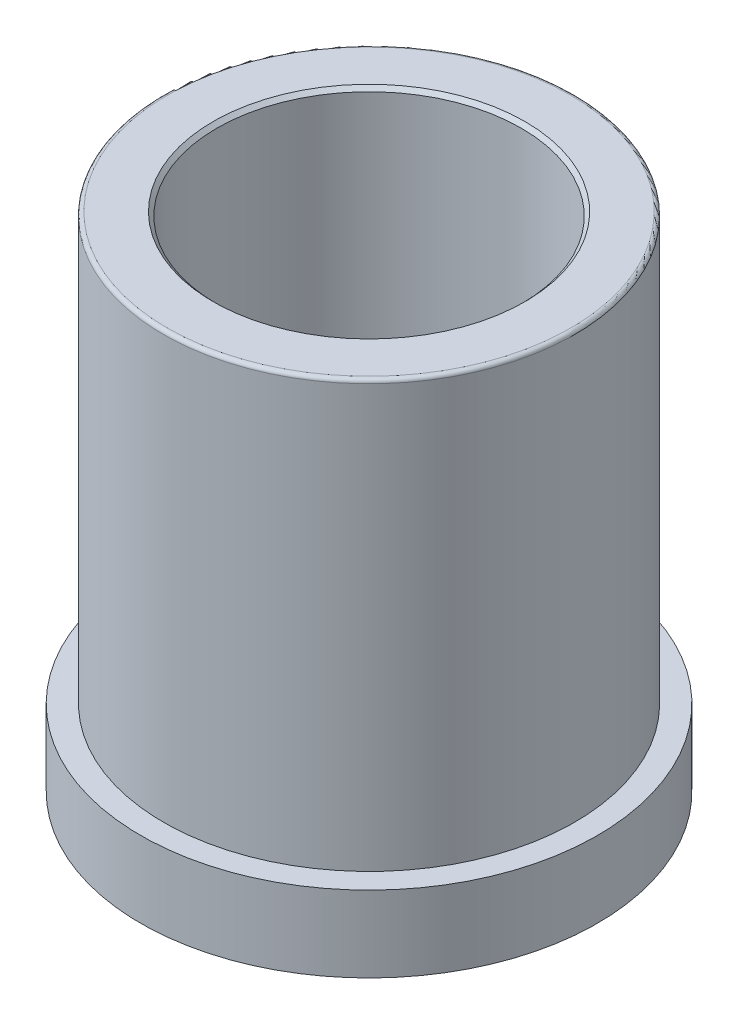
ISO-10303-21;
HEADER;
FILE_DESCRIPTION(('STEP AP214'),'2;1');
FILE_NAME('part.step','',(''),(''),'','','');
FILE_SCHEMA(('AUTOMOTIVE_DESIGN { 1 0 10303 214 1 1 1 1 }'));
ENDSEC;
DATA;
#1=APPLICATION_CONTEXT('core data for automotive mechanical design processes');
#2=APPLICATION_PROTOCOL_DEFINITION('international standard','automotive_design',2000,#1);
#3=PRODUCT_CONTEXT('',#1,'mechanical');
#4=PRODUCT('Part','Part','',(#3));
#5=PRODUCT_RELATED_PRODUCT_CATEGORY('part','',(#4));
#6=PRODUCT_DEFINITION_FORMATION('','',#4);
#7=PRODUCT_DEFINITION_CONTEXT('part definition',#1,'design');
#8=PRODUCT_DEFINITION('design','',#6,#7);
#9=PRODUCT_DEFINITION_SHAPE('','',#8);
#10=(LENGTH_UNIT() NAMED_UNIT(*) SI_UNIT(.MILLI.,.METRE.));
#11=(NAMED_UNIT(*) PLANE_ANGLE_UNIT() SI_UNIT($,.RADIAN.));
#12=(NAMED_UNIT(*) SI_UNIT($,.STERADIAN.) SOLID_ANGLE_UNIT());
#13=UNCERTAINTY_MEASURE_WITH_UNIT(LENGTH_MEASURE(1.E-05),#10,'distance_accuracy_value','');
#14=(GEOMETRIC_REPRESENTATION_CONTEXT(3) GLOBAL_UNCERTAINTY_ASSIGNED_CONTEXT((#13)) GLOBAL_UNIT_ASSIGNED_CONTEXT((#10,
#11,#12)) REPRESENTATION_CONTEXT('',''));
#15=CARTESIAN_POINT('',(0.,0.,0.));
#16=DIRECTION('',(0.,0.,1.));
#17=DIRECTION('',(1.,0.,0.));
#18=AXIS2_PLACEMENT_3D('',#15,#16,#17);
#19=CARTESIAN_POINT('',(0.,0.,0.));
#20=DIRECTION('',(0.,-1.,0.));
#21=DIRECTION('',(0.,0.,-1.));
#22=AXIS2_PLACEMENT_3D('',#19,#20,#21);
#23=CYLINDRICAL_SURFACE('',#22,27.);
#24=CARTESIAN_POINT('',(0.,55.5,0.));
#25=DIRECTION('',(0.,-1.,0.));
#26=DIRECTION('',(0.,0.,-1.));
#27=AXIS2_PLACEMENT_3D('',#24,#25,#26);
#28=CIRCLE('',#27,27.);
#29=CARTESIAN_POINT('',(0.,55.5,-27.));
#30=VERTEX_POINT('',#29);
#31=EDGE_CURVE('E21',#30,#30,#28,.T.);
#32=ORIENTED_EDGE('',*,*,#31,.T.);
#33=EDGE_LOOP('',(#32));
#34=FACE_BOUND('',#33,.T.);
#35=CARTESIAN_POINT('',(0.,0.,0.));
#36=DIRECTION('',(0.,-1.,0.));
#37=DIRECTION('',(0.,0.,-1.));
#38=AXIS2_PLACEMENT_3D('',#35,#36,#37);
#39=CIRCLE('',#38,27.);
#40=CARTESIAN_POINT('',(0.,0.,-27.));
#41=VERTEX_POINT('',#40);
#42=EDGE_CURVE('E49',#41,#41,#39,.T.);
#43=ORIENTED_EDGE('',*,*,#42,.F.);
#44=EDGE_LOOP('',(#43));
#45=FACE_BOUND('',#44,.T.);
#46=ADVANCED_FACE('F14',(#34,#45),#23,.T.);
#47=CARTESIAN_POINT('',(-27.,56.,0.));
#48=DIRECTION('',(0.,-1.,0.));
#49=DIRECTION('',(0.,0.,-1.));
#50=AXIS2_PLACEMENT_3D('',#47,#48,#49);
#51=PLANE('',#50);
#52=CARTESIAN_POINT('',(0.,56.,0.));
#53=DIRECTION('',(0.,-1.,0.));
#54=DIRECTION('',(0.,0.,-1.));
#55=AXIS2_PLACEMENT_3D('',#52,#53,#54);
#56=CIRCLE('',#55,26.5);
#57=CARTESIAN_POINT('',(0.,56.,-26.5));
#58=VERTEX_POINT('',#57);
#59=EDGE_CURVE('E9',#58,#58,#56,.F.);
#60=ORIENTED_EDGE('',*,*,#59,.T.);
#61=EDGE_LOOP('',(#60));
#62=FACE_BOUND('',#61,.T.);
#63=CARTESIAN_POINT('',(0.,56.,0.));
#64=DIRECTION('',(0.,-1.,0.));
#65=DIRECTION('',(0.,0.,-1.));
#66=AXIS2_PLACEMENT_3D('',#63,#64,#65);
#67=CIRCLE('',#66,20.5);
#68=CARTESIAN_POINT('',(0.,56.,-20.5));
#69=VERTEX_POINT('',#68);
#70=EDGE_CURVE('E37',#69,#69,#67,.T.);
#71=ORIENTED_EDGE('',*,*,#70,.T.);
#72=EDGE_LOOP('',(#71));
#73=FACE_BOUND('',#72,.T.);
#74=ADVANCED_FACE('F56',(#62,#73),#51,.F.);
#75=CARTESIAN_POINT('',(0.,0.,0.));
#76=DIRECTION('',(0.,-1.,0.));
#77=DIRECTION('',(0.,0.,-1.));
#78=AXIS2_PLACEMENT_3D('',#75,#76,#77);
#79=CYLINDRICAL_SURFACE('',#78,20.);
#80=CARTESIAN_POINT('',(0.,55.5,0.));
#81=DIRECTION('',(0.,-1.,0.));
#82=DIRECTION('',(0.,0.,-1.));
#83=AXIS2_PLACEMENT_3D('',#80,#81,#82);
#84=CIRCLE('',#83,20.);
#85=CARTESIAN_POINT('',(0.,55.5,-20.));
#86=VERTEX_POINT('',#85);
#87=EDGE_CURVE('E34',#86,#86,#84,.F.);
#88=ORIENTED_EDGE('',*,*,#87,.T.);
#89=EDGE_LOOP('',(#88));
#90=FACE_BOUND('',#89,.T.);
#91=CARTESIAN_POINT('',(0.,-10.,0.));
#92=DIRECTION('',(0.,-1.,0.));
#93=DIRECTION('',(0.,0.,-1.));
#94=AXIS2_PLACEMENT_3D('',#91,#92,#93);
#95=CIRCLE('',#94,20.);
#96=CARTESIAN_POINT('',(0.,-10.,-20.));
#97=VERTEX_POINT('',#96);
#98=EDGE_CURVE('E40',#97,#97,#95,.T.);
#99=ORIENTED_EDGE('',*,*,#98,.T.);
#100=EDGE_LOOP('',(#99));
#101=FACE_BOUND('',#100,.T.);
#102=ADVANCED_FACE('F63',(#90,#101),#79,.F.);
#103=CARTESIAN_POINT('',(0.,-10.15,0.));
#104=DIRECTION('',(0.,-1.,0.));
#105=DIRECTION('',(0.,0.,-1.));
#106=AXIS2_PLACEMENT_3D('',#103,#104,#105);
#107=CONICAL_SURFACE('',#106,20.1,0.588002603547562);
#108=CARTESIAN_POINT('',(0.,-10.36,0.));
#109=DIRECTION('',(0.,1.,0.));
#110=DIRECTION('',(0.,0.,1.));
#111=AXIS2_PLACEMENT_3D('',#108,#109,#110);
#112=CIRCLE('',#111,20.24);
#113=CARTESIAN_POINT('',(0.,-10.36,20.24));
#114=VERTEX_POINT('',#113);
#115=EDGE_CURVE('E25',#114,#114,#112,.F.);
#116=ORIENTED_EDGE('',*,*,#115,.T.);
#117=EDGE_LOOP('',(#116));
#118=FACE_BOUND('',#117,.T.);
#119=ORIENTED_EDGE('',*,*,#98,.F.);
#120=EDGE_LOOP('',(#119));
#121=FACE_BOUND('',#120,.T.);
#122=ADVANCED_FACE('F82',(#118,#121),#107,.F.);
#123=CARTESIAN_POINT('',(-20.1,-10.,0.));
#124=DIRECTION('',(0.,1.,0.));
#125=DIRECTION('',(0.,0.,1.));
#126=AXIS2_PLACEMENT_3D('',#123,#124,#125);
#127=PLANE('',#126);
#128=CARTESIAN_POINT('',(0.,-10.,0.));
#129=DIRECTION('',(0.,1.,0.));
#130=DIRECTION('',(0.,0.,1.));
#131=AXIS2_PLACEMENT_3D('',#128,#129,#130);
#132=CIRCLE('',#131,20.6);
#133=CARTESIAN_POINT('',(0.,-10.,20.6));
#134=VERTEX_POINT('',#133);
#135=EDGE_CURVE('E29',#134,#134,#132,.T.);
#136=ORIENTED_EDGE('',*,*,#135,.T.);
#137=EDGE_LOOP('',(#136));
#138=FACE_BOUND('',#137,.T.);
#139=CARTESIAN_POINT('',(0.,-10.,0.));
#140=DIRECTION('',(0.,-1.,0.));
#141=DIRECTION('',(0.,0.,-1.));
#142=AXIS2_PLACEMENT_3D('',#139,#140,#141);
#143=CIRCLE('',#142,30.);
#144=CARTESIAN_POINT('',(0.,-10.,-30.));
#145=VERTEX_POINT('',#144);
#146=EDGE_CURVE('E43',#145,#145,#143,.T.);
#147=ORIENTED_EDGE('',*,*,#146,.T.);
#148=EDGE_LOOP('',(#147));
#149=FACE_BOUND('',#148,.T.);
#150=ADVANCED_FACE('F85',(#138,#149),#127,.F.);
#151=CARTESIAN_POINT('',(0.,0.,0.));
#152=DIRECTION('',(0.,-1.,0.));
#153=DIRECTION('',(0.,0.,-1.));
#154=AXIS2_PLACEMENT_3D('',#151,#152,#153);
#155=CYLINDRICAL_SURFACE('',#154,30.);
#156=ORIENTED_EDGE('',*,*,#146,.F.);
#157=EDGE_LOOP('',(#156));
#158=FACE_BOUND('',#157,.T.);
#159=CARTESIAN_POINT('',(0.,0.,0.));
#160=DIRECTION('',(0.,-1.,0.));
#161=DIRECTION('',(0.,0.,-1.));
#162=AXIS2_PLACEMENT_3D('',#159,#160,#161);
#163=CIRCLE('',#162,30.);
#164=CARTESIAN_POINT('',(0.,0.,-30.));
#165=VERTEX_POINT('',#164);
#166=EDGE_CURVE('E46',#165,#165,#163,.T.);
#167=ORIENTED_EDGE('',*,*,#166,.T.);
#168=EDGE_LOOP('',(#167));
#169=FACE_BOUND('',#168,.T.);
#170=ADVANCED_FACE('F97',(#158,#169),#155,.T.);
#171=CARTESIAN_POINT('',(-30.,0.,0.));
#172=DIRECTION('',(0.,-1.,0.));
#173=DIRECTION('',(0.,0.,-1.));
#174=AXIS2_PLACEMENT_3D('',#171,#172,#173);
#175=PLANE('',#174);
#176=ORIENTED_EDGE('',*,*,#166,.F.);
#177=EDGE_LOOP('',(#176));
#178=FACE_BOUND('',#177,.T.);
#179=ORIENTED_EDGE('',*,*,#42,.T.);
#180=EDGE_LOOP('',(#179));
#181=FACE_BOUND('',#180,.T.);
#182=ADVANCED_FACE('F53',(#178,#181),#175,.F.);
#183=CARTESIAN_POINT('',(0.,56.,0.));
#184=DIRECTION('',(0.,1.,0.));
#185=DIRECTION('',(0.,0.,1.));
#186=AXIS2_PLACEMENT_3D('',#183,#184,#185);
#187=CONICAL_SURFACE('',#186,20.5,0.785398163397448);
#188=ORIENTED_EDGE('',*,*,#87,.F.);
#189=EDGE_LOOP('',(#188));
#190=FACE_BOUND('',#189,.T.);
#191=ORIENTED_EDGE('',*,*,#70,.F.);
#192=EDGE_LOOP('',(#191));
#193=FACE_BOUND('',#192,.T.);
#194=ADVANCED_FACE('F67',(#190,#193),#187,.F.);
#195=CARTESIAN_POINT('',(0.,-10.5,0.));
#196=DIRECTION('',(0.,1.,0.));
#197=DIRECTION('',(0.,0.,1.));
#198=AXIS2_PLACEMENT_3D('',#195,#196,#197);
#199=CONICAL_SURFACE('',#198,20.1,0.785398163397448);
#200=ORIENTED_EDGE('',*,*,#135,.F.);
#201=EDGE_LOOP('',(#200));
#202=FACE_BOUND('',#201,.T.);
#203=ORIENTED_EDGE('',*,*,#115,.F.);
#204=EDGE_LOOP('',(#203));
#205=FACE_BOUND('',#204,.T.);
#206=ADVANCED_FACE('F69',(#202,#205),#199,.T.);
#207=CARTESIAN_POINT('',(0.,55.5,0.));
#208=DIRECTION('',(0.,-1.,0.));
#209=DIRECTION('',(0.,0.,-1.));
#210=AXIS2_PLACEMENT_3D('',#207,#208,#209);
#211=TOROIDAL_SURFACE('',#210,26.5,0.5);
#212=ORIENTED_EDGE('',*,*,#59,.F.);
#213=EDGE_LOOP('',(#212));
#214=FACE_BOUND('',#213,.T.);
#215=ORIENTED_EDGE('',*,*,#31,.F.);
#216=EDGE_LOOP('',(#215));
#217=FACE_BOUND('',#216,.T.);
#218=ADVANCED_FACE('F16',(#214,#217),#211,.T.);
#219=CLOSED_SHELL('',(#46,#74,#102,#122,#150,#170,#182,#194,#206,#218));
#220=MANIFOLD_SOLID_BREP('B1',#219);
#221=ADVANCED_BREP_SHAPE_REPRESENTATION('',(#18,#220),#14);
#222=SHAPE_DEFINITION_REPRESENTATION(#9,#221);
ENDSEC;
END-ISO-10303-21;
